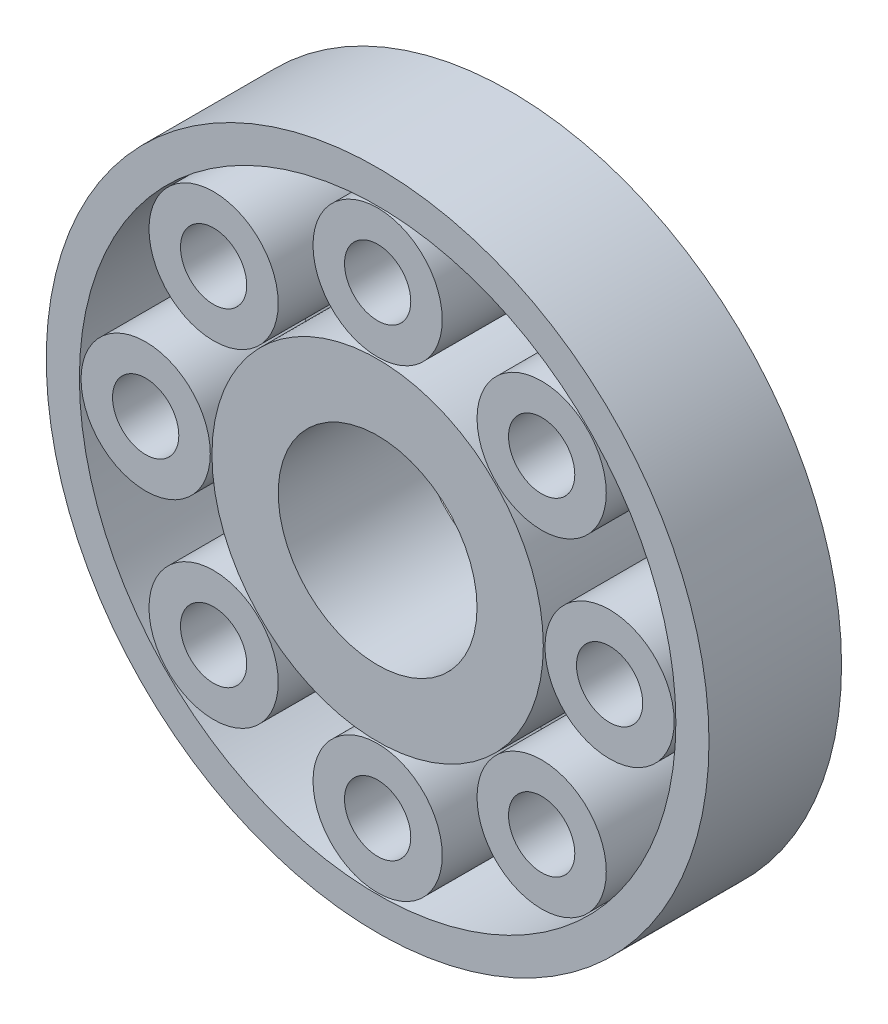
from build123d import *

# Parameters (mm, degrees)
SKETCH1_R            = 10
BOSS_EXTRUDE1_DEPTH  = 4
CUT_EXTRUDE5_START   = -0.5
SKETCH5_R            = 9
SKETCH5_R_2          = 1.95
SKETCH5_R_3          = 5
CUT_EXTRUDE5_DEPTH   = 3.5
SKETCH10_R           = 4
BOSS_EXTRUDE12_DEPTH = 0.2
CUT_EXTRUDE7_REACH   = 16.753
SKETCH8_R            = 3
SKETCH8_R_2          = 1
FILLET2_R            = 0.1


with BuildPart() as part:
    # Sketch1 → Boss-Extrude1 (new body)
    with BuildSketch(Plane.XY):
        Circle(SKETCH1_R)
    extrude(amount=BOSS_EXTRUDE1_DEPTH)

    # Sketch5 → Cut-Extrude5 (cut)
    with BuildSketch(Plane(origin=(0, 0, 0), x_dir=(-1, 0, 0), z_dir=(0, 0, -1)).offset(CUT_EXTRUDE5_START)):
        Circle(SKETCH5_R)
        with Locations((0, 7)):
            Circle(SKETCH5_R_2, mode=Mode.SUBTRACT)
        Circle(SKETCH5_R_3, mode=Mode.SUBTRACT)
        with Locations((4.949747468, 4.949747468)):
            Circle(SKETCH5_R_2, mode=Mode.SUBTRACT)
        with Locations((7, 0)):
            Circle(SKETCH5_R_2, mode=Mode.SUBTRACT)
        with Locations((4.949747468, -4.949747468)):
            Circle(SKETCH5_R_2, mode=Mode.SUBTRACT)
        with Locations((0, -7)):
            Circle(SKETCH5_R_2, mode=Mode.SUBTRACT)
        with Locations((-4.949747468, -4.949747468)):
            Circle(SKETCH5_R_2, mode=Mode.SUBTRACT)
        with Locations((-7, 0)):
            Circle(SKETCH5_R_2, mode=Mode.SUBTRACT)
        with Locations((-4.949747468, 4.949747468)):
            Circle(SKETCH5_R_2, mode=Mode.SUBTRACT)
    extrude(amount=-CUT_EXTRUDE5_DEPTH, mode=Mode.SUBTRACT)

    # Sketch10 → Boss-Extrude12 (add)
    with BuildSketch(Plane(origin=(0, 0, 0), x_dir=(-1, 0, 0), z_dir=(0, 0, -1))):
        with Locations(Location((0, 0, 0), (0, 0, 180))):
            Circle(SKETCH10_R)
    extrude(amount=BOSS_EXTRUDE12_DEPTH)

    # Sketch8 → Cut-Extrude7 (cut, up to next)
    with BuildSketch(Plane.XY.offset(4), mode=Mode.PRIVATE) as cut_extrude7_sk1:
        Circle(SKETCH8_R)
    cut_extrude7_tool1 = extrude(cut_extrude7_sk1.sketch, amount=-CUT_EXTRUDE7_REACH, mode=Mode.PRIVATE) & part.part
    # Sketch8 → Cut-Extrude7 (cut, up to next)
    with BuildSketch(Plane.XY.offset(4), mode=Mode.PRIVATE) as cut_extrude7_sk2:
        with Locations((0, 7)):
            Circle(SKETCH8_R_2)
    cut_extrude7_tool2 = extrude(cut_extrude7_sk2.sketch, amount=-CUT_EXTRUDE7_REACH, mode=Mode.PRIVATE) & part.part
    # Sketch8 → Cut-Extrude7 (cut, up to next)
    with BuildSketch(Plane.XY.offset(4), mode=Mode.PRIVATE) as cut_extrude7_sk3:
        with Locations((4.949747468, 4.949747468)):
            Circle(SKETCH8_R_2)
    cut_extrude7_tool3 = extrude(cut_extrude7_sk3.sketch, amount=-CUT_EXTRUDE7_REACH, mode=Mode.PRIVATE) & part.part
    # Sketch8 → Cut-Extrude7 (cut, up to next)
    with BuildSketch(Plane.XY.offset(4), mode=Mode.PRIVATE) as cut_extrude7_sk4:
        with Locations((7, 0)):
            Circle(SKETCH8_R_2)
    cut_extrude7_tool4 = extrude(cut_extrude7_sk4.sketch, amount=-CUT_EXTRUDE7_REACH, mode=Mode.PRIVATE) & part.part
    # Sketch8 → Cut-Extrude7 (cut, up to next)
    with BuildSketch(Plane.XY.offset(4), mode=Mode.PRIVATE) as cut_extrude7_sk5:
        with Locations((4.949747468, -4.949747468)):
            Circle(SKETCH8_R_2)
    cut_extrude7_tool5 = extrude(cut_extrude7_sk5.sketch, amount=-CUT_EXTRUDE7_REACH, mode=Mode.PRIVATE) & part.part
    # Sketch8 → Cut-Extrude7 (cut, up to next)
    with BuildSketch(Plane.XY.offset(4), mode=Mode.PRIVATE) as cut_extrude7_sk6:
        with Locations((0, -7)):
            Circle(SKETCH8_R_2)
    cut_extrude7_tool6 = extrude(cut_extrude7_sk6.sketch, amount=-CUT_EXTRUDE7_REACH, mode=Mode.PRIVATE) & part.part
    # Sketch8 → Cut-Extrude7 (cut, up to next)
    with BuildSketch(Plane.XY.offset(4), mode=Mode.PRIVATE) as cut_extrude7_sk7:
        with Locations((-4.949747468, -4.949747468)):
            Circle(SKETCH8_R_2)
    cut_extrude7_tool7 = extrude(cut_extrude7_sk7.sketch, amount=-CUT_EXTRUDE7_REACH, mode=Mode.PRIVATE) & part.part
    # Sketch8 → Cut-Extrude7 (cut, up to next)
    with BuildSketch(Plane.XY.offset(4), mode=Mode.PRIVATE) as cut_extrude7_sk8:
        with Locations((-7, 0)):
            Circle(SKETCH8_R_2)
    cut_extrude7_tool8 = extrude(cut_extrude7_sk8.sketch, amount=-CUT_EXTRUDE7_REACH, mode=Mode.PRIVATE) & part.part
    # Sketch8 → Cut-Extrude7 (cut, up to next)
    with BuildSketch(Plane.XY.offset(4), mode=Mode.PRIVATE) as cut_extrude7_sk9:
        with Locations((-4.949747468, 4.949747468)):
            Circle(SKETCH8_R_2)
    cut_extrude7_tool9 = extrude(cut_extrude7_sk9.sketch, amount=-CUT_EXTRUDE7_REACH, mode=Mode.PRIVATE) & part.part
    add(cut_extrude7_tool1.solids().sort_by_distance((0, 0, 4))[0], mode=Mode.SUBTRACT)
    add(cut_extrude7_tool2.solids().sort_by_distance((0, 7, 4))[0], mode=Mode.SUBTRACT)
    add(cut_extrude7_tool3.solids().sort_by_distance((4.949747, 4.949747, 4))[0], mode=Mode.SUBTRACT)
    add(cut_extrude7_tool4.solids().sort_by_distance((7, 0, 4))[0], mode=Mode.SUBTRACT)
    add(cut_extrude7_tool5.solids().sort_by_distance((4.949747, -4.949747, 4))[0], mode=Mode.SUBTRACT)
    add(cut_extrude7_tool6.solids().sort_by_distance((0, -7, 4))[0], mode=Mode.SUBTRACT)
    add(cut_extrude7_tool7.solids().sort_by_distance((-4.949747, -4.949747, 4))[0], mode=Mode.SUBTRACT)
    add(cut_extrude7_tool8.solids().sort_by_distance((-7, 0, 4))[0], mode=Mode.SUBTRACT)
    add(cut_extrude7_tool9.solids().sort_by_distance((-4.949747, 4.949747, 4))[0], mode=Mode.SUBTRACT)

    # Fillet2
    fillet2_edges = [part.edges().sort_by_distance(p)[0] for p in [
        (-4, 0, -0.2),
    ]]
    fillet(fillet2_edges, radius=FILLET2_R)


solid = part.part
